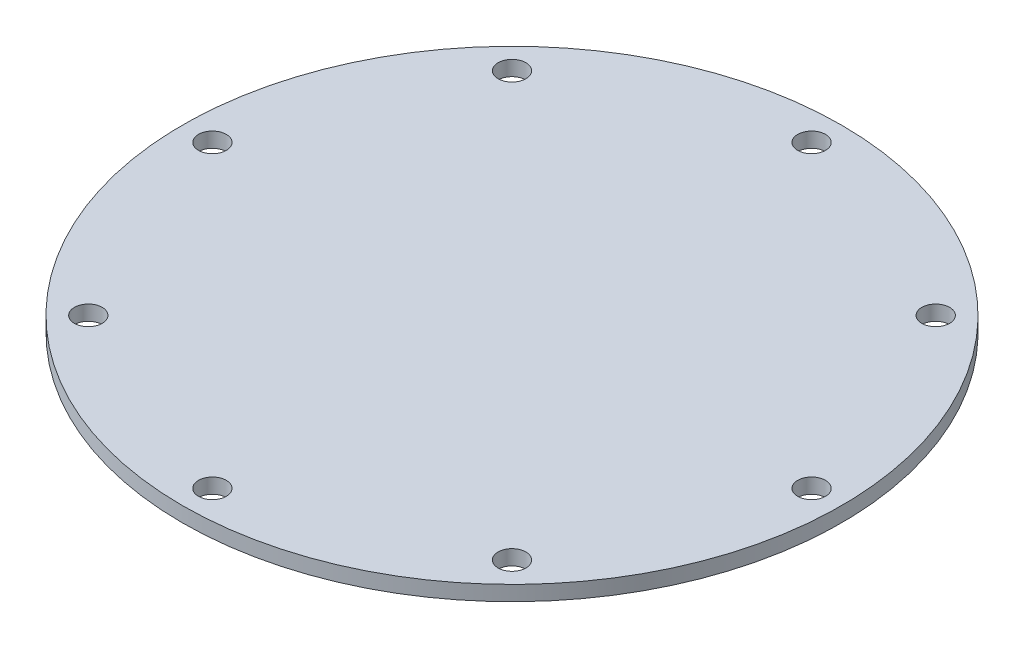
from build123d import *

# Parameters (mm, degrees)
SKETCH1_W             = 34.925
SKETCH1_H             = 1.5875
F_4_CLEARANCE_HOLE1_D = 2.9464
CIRPATTERN1_COUNT     = 8


with BuildPart() as part:
    # Sketch1 → Revolve1 (revolve)
    with BuildSketch(Plane.XY, mode=Mode.PRIVATE) as revolve1_sk:
        with Locations((-17.4625, 0.79375)):
            Rectangle(SKETCH1_W, SKETCH1_H)
    revolve(revolve1_sk.sketch.rotate(Axis((0, 0, 0), (0, 1, 0)), 270), axis=Axis((0, 0, 0), (0, 1, 0)))

    # 4 Clearance Hole1 (through all)
    with Locations(Plane(origin=(0, 1.5875, 0), x_dir=(1, 0, 0), z_dir=(0, 1, 0))):
        with Locations((-31.75, 0)):
            f_4_clearance_hole1 = Hole(F_4_CLEARANCE_HOLE1_D / 2)

    # CirPattern1: 4 Clearance Hole1 ×8 about axis
    cirpattern1_axis = Axis((0, 0, 0), (0, 1, 0))
    for i in range(1, CIRPATTERN1_COUNT):
        add(f_4_clearance_hole1.rotate(cirpattern1_axis, i * 360 / CIRPATTERN1_COUNT), mode=Mode.SUBTRACT)


solid = part.part
